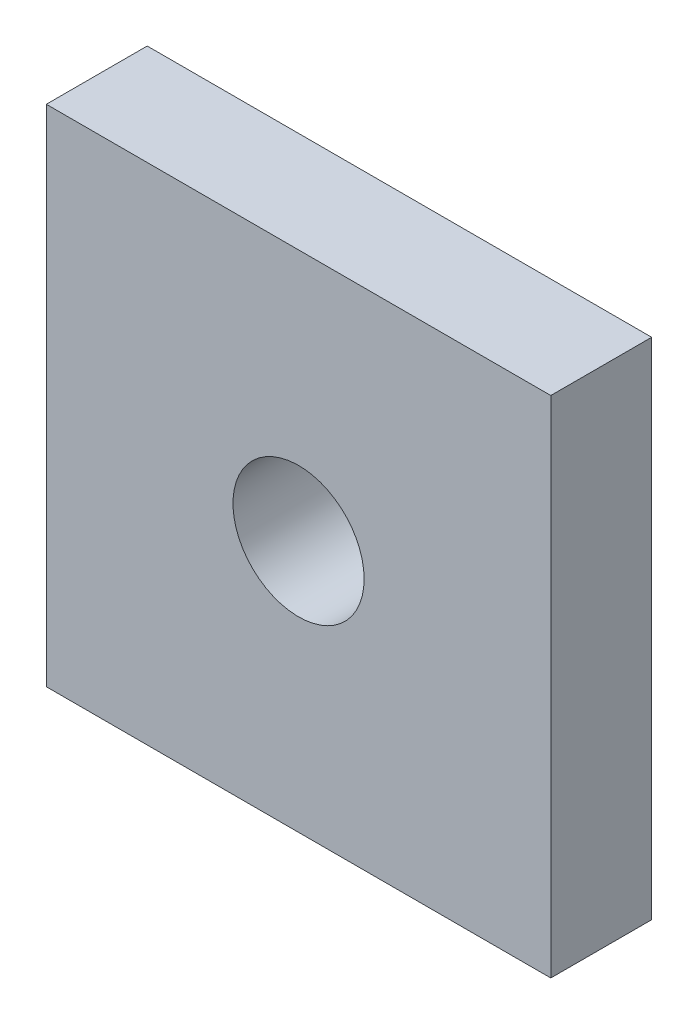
ISO-10303-21;
HEADER;
FILE_DESCRIPTION(('STEP AP214'),'2;1');
FILE_NAME('part.step','',(''),(''),'','','');
FILE_SCHEMA(('AUTOMOTIVE_DESIGN { 1 0 10303 214 1 1 1 1 }'));
ENDSEC;
DATA;
#1=APPLICATION_CONTEXT('core data for automotive mechanical design processes');
#2=APPLICATION_PROTOCOL_DEFINITION('international standard','automotive_design',2000,#1);
#3=PRODUCT_CONTEXT('',#1,'mechanical');
#4=PRODUCT('Part','Part','',(#3));
#5=PRODUCT_RELATED_PRODUCT_CATEGORY('part','',(#4));
#6=PRODUCT_DEFINITION_FORMATION('','',#4);
#7=PRODUCT_DEFINITION_CONTEXT('part definition',#1,'design');
#8=PRODUCT_DEFINITION('design','',#6,#7);
#9=PRODUCT_DEFINITION_SHAPE('','',#8);
#10=(LENGTH_UNIT() NAMED_UNIT(*) SI_UNIT(.MILLI.,.METRE.));
#11=(NAMED_UNIT(*) PLANE_ANGLE_UNIT() SI_UNIT($,.RADIAN.));
#12=(NAMED_UNIT(*) SI_UNIT($,.STERADIAN.) SOLID_ANGLE_UNIT());
#13=UNCERTAINTY_MEASURE_WITH_UNIT(LENGTH_MEASURE(1.E-05),#10,'distance_accuracy_value','');
#14=(GEOMETRIC_REPRESENTATION_CONTEXT(3) GLOBAL_UNCERTAINTY_ASSIGNED_CONTEXT((#13)) GLOBAL_UNIT_ASSIGNED_CONTEXT((#10,
#11,#12)) REPRESENTATION_CONTEXT('',''));
#15=CARTESIAN_POINT('',(0.,0.,0.));
#16=DIRECTION('',(0.,0.,1.));
#17=DIRECTION('',(1.,0.,0.));
#18=AXIS2_PLACEMENT_3D('',#15,#16,#17);
#19=CARTESIAN_POINT('',(-12.5,-12.5,5.));
#20=DIRECTION('',(1.,0.,0.));
#21=DIRECTION('',(0.,0.,-1.));
#22=AXIS2_PLACEMENT_3D('',#19,#20,#21);
#23=PLANE('',#22);
#24=DIRECTION('',(0.,-1.,0.));
#25=VECTOR('',#24,1.);
#26=CARTESIAN_POINT('',(-12.5,-12.5,0.));
#27=LINE('',#26,#25);
#28=CARTESIAN_POINT('',(-12.5,12.5,0.));
#29=VERTEX_POINT('',#28);
#30=CARTESIAN_POINT('',(-12.5,-12.5,0.));
#31=VERTEX_POINT('',#30);
#32=EDGE_CURVE('E106',#29,#31,#27,.T.);
#33=ORIENTED_EDGE('',*,*,#32,.T.);
#34=DIRECTION('',(0.,0.,-1.));
#35=VECTOR('',#34,1.);
#36=CARTESIAN_POINT('',(-12.5,-12.5,5.));
#37=LINE('',#36,#35);
#38=CARTESIAN_POINT('',(-12.5,-12.5,5.));
#39=VERTEX_POINT('',#38);
#40=EDGE_CURVE('E11',#39,#31,#37,.T.);
#41=ORIENTED_EDGE('',*,*,#40,.F.);
#42=DIRECTION('',(0.,-1.,0.));
#43=VECTOR('',#42,1.);
#44=CARTESIAN_POINT('',(-12.5,-12.5,5.));
#45=LINE('',#44,#43);
#46=CARTESIAN_POINT('',(-12.5,12.5,5.));
#47=VERTEX_POINT('',#46);
#48=EDGE_CURVE('E90',#47,#39,#45,.T.);
#49=ORIENTED_EDGE('',*,*,#48,.F.);
#50=DIRECTION('',(0.,0.,-1.));
#51=VECTOR('',#50,1.);
#52=CARTESIAN_POINT('',(-12.5,12.5,5.));
#53=LINE('',#52,#51);
#54=EDGE_CURVE('E102',#47,#29,#53,.T.);
#55=ORIENTED_EDGE('',*,*,#54,.T.);
#56=EDGE_LOOP('',(#33,#41,#49,#55));
#57=FACE_BOUND('',#56,.T.);
#58=ADVANCED_FACE('F38',(#57),#23,.F.);
#59=CARTESIAN_POINT('',(12.5,-12.5,5.));
#60=DIRECTION('',(0.,1.,0.));
#61=DIRECTION('',(-1.,0.,0.));
#62=AXIS2_PLACEMENT_3D('',#59,#60,#61);
#63=PLANE('',#62);
#64=DIRECTION('',(1.,0.,0.));
#65=VECTOR('',#64,1.);
#66=CARTESIAN_POINT('',(12.5,-12.5,0.));
#67=LINE('',#66,#65);
#68=CARTESIAN_POINT('',(12.5,-12.5,0.));
#69=VERTEX_POINT('',#68);
#70=EDGE_CURVE('E95',#31,#69,#67,.T.);
#71=ORIENTED_EDGE('',*,*,#70,.T.);
#72=DIRECTION('',(0.,0.,-1.));
#73=VECTOR('',#72,1.);
#74=CARTESIAN_POINT('',(12.5,-12.5,5.));
#75=LINE('',#74,#73);
#76=CARTESIAN_POINT('',(12.5,-12.5,5.));
#77=VERTEX_POINT('',#76);
#78=EDGE_CURVE('E47',#77,#69,#75,.T.);
#79=ORIENTED_EDGE('',*,*,#78,.F.);
#80=DIRECTION('',(1.,0.,0.));
#81=VECTOR('',#80,1.);
#82=CARTESIAN_POINT('',(12.5,-12.5,5.));
#83=LINE('',#82,#81);
#84=EDGE_CURVE('E85',#39,#77,#83,.T.);
#85=ORIENTED_EDGE('',*,*,#84,.F.);
#86=ORIENTED_EDGE('',*,*,#40,.T.);
#87=EDGE_LOOP('',(#71,#79,#85,#86));
#88=FACE_BOUND('',#87,.T.);
#89=ADVANCED_FACE('F94',(#88),#63,.F.);
#90=CARTESIAN_POINT('',(12.5,-12.5,5.));
#91=DIRECTION('',(-1.,0.,0.));
#92=DIRECTION('',(0.,0.,1.));
#93=AXIS2_PLACEMENT_3D('',#90,#91,#92);
#94=PLANE('',#93);
#95=DIRECTION('',(0.,1.,0.));
#96=VECTOR('',#95,1.);
#97=CARTESIAN_POINT('',(12.5,-12.5,0.));
#98=LINE('',#97,#96);
#99=CARTESIAN_POINT('',(12.5,12.5,0.));
#100=VERTEX_POINT('',#99);
#101=EDGE_CURVE('E72',#69,#100,#98,.T.);
#102=ORIENTED_EDGE('',*,*,#101,.T.);
#103=DIRECTION('',(0.,0.,-1.));
#104=VECTOR('',#103,1.);
#105=CARTESIAN_POINT('',(12.5,12.5,5.));
#106=LINE('',#105,#104);
#107=CARTESIAN_POINT('',(12.5,12.5,5.));
#108=VERTEX_POINT('',#107);
#109=EDGE_CURVE('E97',#108,#100,#106,.T.);
#110=ORIENTED_EDGE('',*,*,#109,.F.);
#111=DIRECTION('',(0.,1.,0.));
#112=VECTOR('',#111,1.);
#113=CARTESIAN_POINT('',(12.5,-12.5,5.));
#114=LINE('',#113,#112);
#115=EDGE_CURVE('E88',#77,#108,#114,.T.);
#116=ORIENTED_EDGE('',*,*,#115,.F.);
#117=ORIENTED_EDGE('',*,*,#78,.T.);
#118=EDGE_LOOP('',(#102,#110,#116,#117));
#119=FACE_BOUND('',#118,.T.);
#120=ADVANCED_FACE('F98',(#119),#94,.F.);
#121=CARTESIAN_POINT('',(12.5,12.5,5.));
#122=DIRECTION('',(0.,-1.,0.));
#123=DIRECTION('',(1.,0.,0.));
#124=AXIS2_PLACEMENT_3D('',#121,#122,#123);
#125=PLANE('',#124);
#126=DIRECTION('',(-1.,0.,0.));
#127=VECTOR('',#126,1.);
#128=CARTESIAN_POINT('',(12.5,12.5,0.));
#129=LINE('',#128,#127);
#130=EDGE_CURVE('E78',#100,#29,#129,.T.);
#131=ORIENTED_EDGE('',*,*,#130,.T.);
#132=ORIENTED_EDGE('',*,*,#54,.F.);
#133=DIRECTION('',(-1.,0.,0.));
#134=VECTOR('',#133,1.);
#135=CARTESIAN_POINT('',(12.5,12.5,5.));
#136=LINE('',#135,#134);
#137=EDGE_CURVE('E55',#108,#47,#136,.T.);
#138=ORIENTED_EDGE('',*,*,#137,.F.);
#139=ORIENTED_EDGE('',*,*,#109,.T.);
#140=EDGE_LOOP('',(#131,#132,#138,#139));
#141=FACE_BOUND('',#140,.T.);
#142=ADVANCED_FACE('F120',(#141),#125,.F.);
#143=CARTESIAN_POINT('',(0.,0.,5.));
#144=DIRECTION('',(0.,0.,1.));
#145=DIRECTION('',(1.,0.,0.));
#146=AXIS2_PLACEMENT_3D('',#143,#144,#145);
#147=PLANE('',#146);
#148=CARTESIAN_POINT('',(0.,0.,5.));
#149=DIRECTION('',(0.,0.,1.));
#150=DIRECTION('',(1.,0.,0.));
#151=AXIS2_PLACEMENT_3D('',#148,#149,#150);
#152=CIRCLE('',#151,3.25);
#153=CARTESIAN_POINT('',(3.25,0.,5.));
#154=VERTEX_POINT('',#153);
#155=EDGE_CURVE('E127',#154,#154,#152,.T.);
#156=ORIENTED_EDGE('',*,*,#155,.F.);
#157=EDGE_LOOP('',(#156));
#158=FACE_BOUND('',#157,.T.);
#159=ORIENTED_EDGE('',*,*,#48,.T.);
#160=ORIENTED_EDGE('',*,*,#84,.T.);
#161=ORIENTED_EDGE('',*,*,#115,.T.);
#162=ORIENTED_EDGE('',*,*,#137,.T.);
#163=EDGE_LOOP('',(#159,#160,#161,#162));
#164=FACE_BOUND('',#163,.T.);
#165=ADVANCED_FACE('F86',(#158,#164),#147,.T.);
#166=CARTESIAN_POINT('',(0.,0.,0.));
#167=DIRECTION('',(0.,0.,1.));
#168=DIRECTION('',(1.,0.,0.));
#169=AXIS2_PLACEMENT_3D('',#166,#167,#168);
#170=PLANE('',#169);
#171=CARTESIAN_POINT('',(0.,0.,0.));
#172=DIRECTION('',(0.,0.,1.));
#173=DIRECTION('',(1.,0.,0.));
#174=AXIS2_PLACEMENT_3D('',#171,#172,#173);
#175=CIRCLE('',#174,3.25);
#176=CARTESIAN_POINT('',(3.25,0.,0.));
#177=VERTEX_POINT('',#176);
#178=EDGE_CURVE('E110',#177,#177,#175,.T.);
#179=ORIENTED_EDGE('',*,*,#178,.T.);
#180=EDGE_LOOP('',(#179));
#181=FACE_BOUND('',#180,.T.);
#182=ORIENTED_EDGE('',*,*,#32,.F.);
#183=ORIENTED_EDGE('',*,*,#130,.F.);
#184=ORIENTED_EDGE('',*,*,#101,.F.);
#185=ORIENTED_EDGE('',*,*,#70,.F.);
#186=EDGE_LOOP('',(#182,#183,#184,#185));
#187=FACE_BOUND('',#186,.T.);
#188=ADVANCED_FACE('F123',(#181,#187),#170,.F.);
#189=CARTESIAN_POINT('',(0.,0.,0.));
#190=DIRECTION('',(0.,0.,1.));
#191=DIRECTION('',(1.,0.,0.));
#192=AXIS2_PLACEMENT_3D('',#189,#190,#191);
#193=CYLINDRICAL_SURFACE('',#192,3.25);
#194=ORIENTED_EDGE('',*,*,#178,.F.);
#195=EDGE_LOOP('',(#194));
#196=FACE_BOUND('',#195,.T.);
#197=ORIENTED_EDGE('',*,*,#155,.T.);
#198=EDGE_LOOP('',(#197));
#199=FACE_BOUND('',#198,.T.);
#200=ADVANCED_FACE('F136',(#196,#199),#193,.F.);
#201=CLOSED_SHELL('',(#58,#89,#120,#142,#165,#188,#200));
#202=MANIFOLD_SOLID_BREP('B2',#201);
#203=ADVANCED_BREP_SHAPE_REPRESENTATION('',(#18,#202),#14);
#204=SHAPE_DEFINITION_REPRESENTATION(#9,#203);
ENDSEC;
END-ISO-10303-21;
